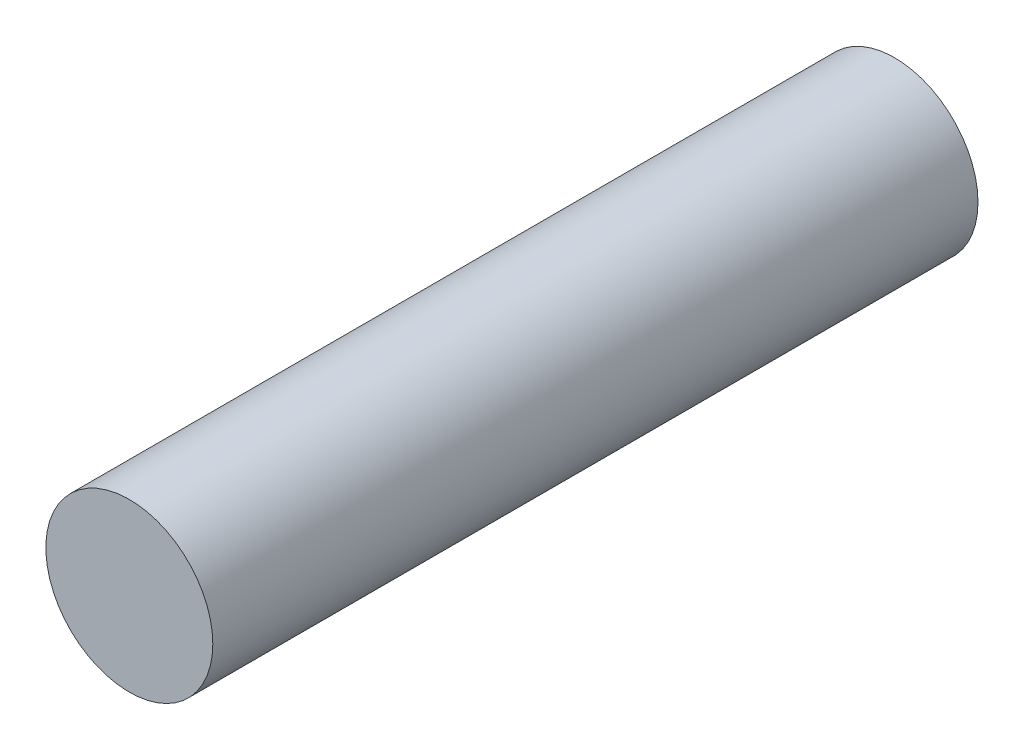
from build123d import *

# Parameters (mm, degrees)
SZKIC1_R                    = 6
DODANIE_WYCI_GNI_CIE1_DEPTH = 55


with BuildPart() as part:
    # Szkic1 → Dodanie-wyci_gni_cie1 (new body)
    with BuildSketch(Plane.XY):
        Circle(SZKIC1_R)
    extrude(amount=DODANIE_WYCI_GNI_CIE1_DEPTH)


solid = part.part
